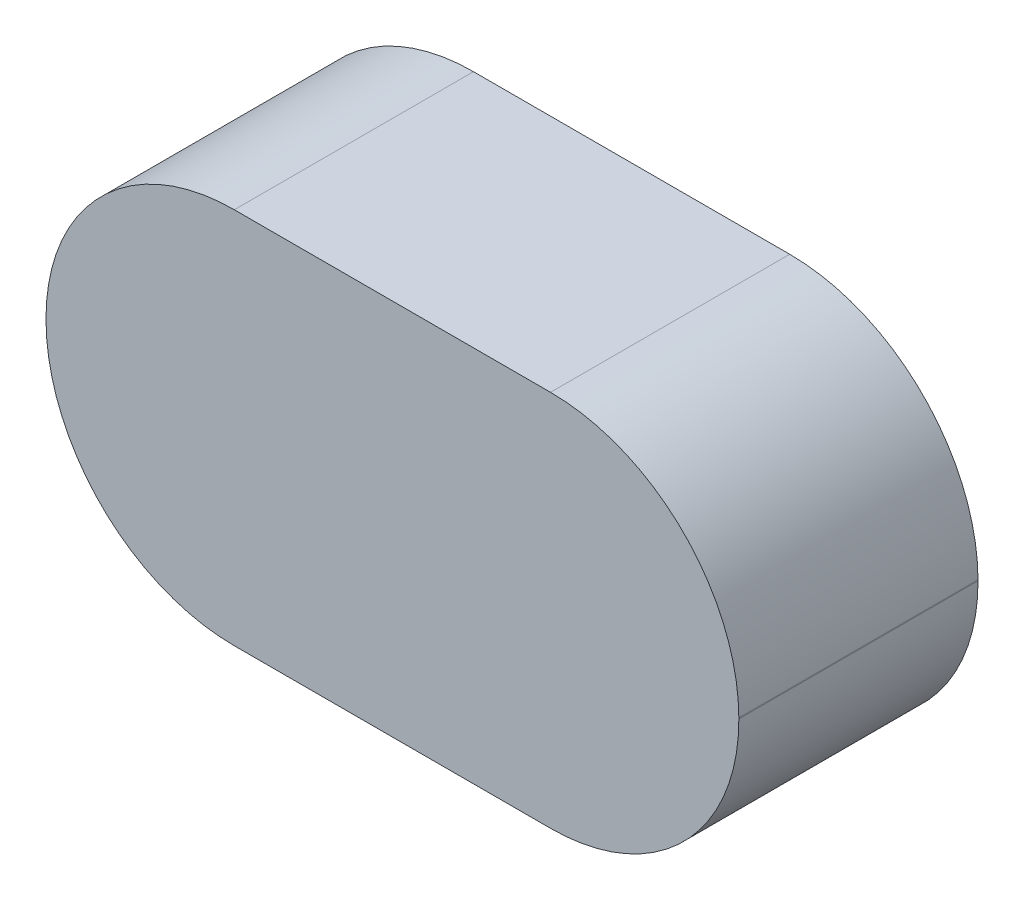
ISO-10303-21;
HEADER;
FILE_DESCRIPTION(('STEP AP214'),'2;1');
FILE_NAME('part.step','',(''),(''),'','','');
FILE_SCHEMA(('AUTOMOTIVE_DESIGN { 1 0 10303 214 1 1 1 1 }'));
ENDSEC;
DATA;
#1=APPLICATION_CONTEXT('core data for automotive mechanical design processes');
#2=APPLICATION_PROTOCOL_DEFINITION('international standard','automotive_design',2000,#1);
#3=PRODUCT_CONTEXT('',#1,'mechanical');
#4=PRODUCT('Part','Part','',(#3));
#5=PRODUCT_RELATED_PRODUCT_CATEGORY('part','',(#4));
#6=PRODUCT_DEFINITION_FORMATION('','',#4);
#7=PRODUCT_DEFINITION_CONTEXT('part definition',#1,'design');
#8=PRODUCT_DEFINITION('design','',#6,#7);
#9=PRODUCT_DEFINITION_SHAPE('','',#8);
#10=(LENGTH_UNIT() NAMED_UNIT(*) SI_UNIT(.MILLI.,.METRE.));
#11=(NAMED_UNIT(*) PLANE_ANGLE_UNIT() SI_UNIT($,.RADIAN.));
#12=(NAMED_UNIT(*) SI_UNIT($,.STERADIAN.) SOLID_ANGLE_UNIT());
#13=UNCERTAINTY_MEASURE_WITH_UNIT(LENGTH_MEASURE(1.E-05),#10,'distance_accuracy_value','');
#14=(GEOMETRIC_REPRESENTATION_CONTEXT(3) GLOBAL_UNCERTAINTY_ASSIGNED_CONTEXT((#13)) GLOBAL_UNIT_ASSIGNED_CONTEXT((#10,
#11,#12)) REPRESENTATION_CONTEXT('',''));
#15=CARTESIAN_POINT('',(0.,0.,0.));
#16=DIRECTION('',(0.,0.,1.));
#17=DIRECTION('',(1.,0.,0.));
#18=AXIS2_PLACEMENT_3D('',#15,#16,#17);
#19=CARTESIAN_POINT('',(-3.5,-2.1,2.413));
#20=DIRECTION('',(1.,0.,0.));
#21=DIRECTION('',(0.,0.,-1.));
#22=AXIS2_PLACEMENT_3D('',#19,#20,#21);
#23=PLANE('',#22);
#24=DIRECTION('',(0.,-1.,0.));
#25=VECTOR('',#24,1.);
#26=CARTESIAN_POINT('',(-3.5,-2.1,2.413));
#27=LINE('',#26,#25);
#28=CARTESIAN_POINT('',(-3.5,-0.190004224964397,2.413));
#29=VERTEX_POINT('',#28);
#30=CARTESIAN_POINT('',(-3.5,-0.199999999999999,2.413));
#31=VERTEX_POINT('',#30);
#32=EDGE_CURVE('E138',#29,#31,#27,.T.);
#33=ORIENTED_EDGE('',*,*,#32,.F.);
#34=DIRECTION('',(0.,0.,-1.));
#35=VECTOR('',#34,1.);
#36=CARTESIAN_POINT('',(-3.5,-0.190004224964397,2.413));
#37=LINE('',#36,#35);
#38=CARTESIAN_POINT('',(-3.5,-0.190004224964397,0.));
#39=VERTEX_POINT('',#38);
#40=EDGE_CURVE('E13',#29,#39,#37,.T.);
#41=ORIENTED_EDGE('',*,*,#40,.T.);
#42=DIRECTION('',(0.,-1.,0.));
#43=VECTOR('',#42,1.);
#44=CARTESIAN_POINT('',(-3.5,-2.1,0.));
#45=LINE('',#44,#43);
#46=CARTESIAN_POINT('',(-3.5,-0.199999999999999,0.));
#47=VERTEX_POINT('',#46);
#48=EDGE_CURVE('E140',#39,#47,#45,.T.);
#49=ORIENTED_EDGE('',*,*,#48,.T.);
#50=DIRECTION('',(0.,0.,-1.));
#51=VECTOR('',#50,1.);
#52=CARTESIAN_POINT('',(-3.5,-0.199999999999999,2.413));
#53=LINE('',#52,#51);
#54=EDGE_CURVE('E51',#47,#31,#53,.F.);
#55=ORIENTED_EDGE('',*,*,#54,.T.);
#56=EDGE_LOOP('',(#33,#41,#49,#55));
#57=FACE_BOUND('',#56,.T.);
#58=ADVANCED_FACE('F43',(#57),#23,.F.);
#59=CARTESIAN_POINT('',(3.49587914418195,-2.1,2.413));
#60=DIRECTION('',(0.,1.,0.));
#61=DIRECTION('',(-1.,0.,0.));
#62=AXIS2_PLACEMENT_3D('',#59,#60,#61);
#63=PLANE('',#62);
#64=DIRECTION('',(1.,0.,0.));
#65=VECTOR('',#64,1.);
#66=CARTESIAN_POINT('',(3.49587914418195,-2.1,0.));
#67=LINE('',#66,#65);
#68=CARTESIAN_POINT('',(-1.6,-2.1,0.));
#69=VERTEX_POINT('',#68);
#70=CARTESIAN_POINT('',(1.59044608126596,-2.1,0.));
#71=VERTEX_POINT('',#70);
#72=EDGE_CURVE('E136',#69,#71,#67,.T.);
#73=ORIENTED_EDGE('',*,*,#72,.T.);
#74=DIRECTION('',(0.,0.,-1.));
#75=VECTOR('',#74,1.);
#76=CARTESIAN_POINT('',(1.59044608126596,-2.1,2.413));
#77=LINE('',#76,#75);
#78=CARTESIAN_POINT('',(1.59044608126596,-2.1,2.413));
#79=VERTEX_POINT('',#78);
#80=EDGE_CURVE('E115',#71,#79,#77,.F.);
#81=ORIENTED_EDGE('',*,*,#80,.T.);
#82=DIRECTION('',(1.,0.,0.));
#83=VECTOR('',#82,1.);
#84=CARTESIAN_POINT('',(3.49587914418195,-2.1,2.413));
#85=LINE('',#84,#83);
#86=CARTESIAN_POINT('',(-1.6,-2.1,2.413));
#87=VERTEX_POINT('',#86);
#88=EDGE_CURVE('E176',#87,#79,#85,.T.);
#89=ORIENTED_EDGE('',*,*,#88,.F.);
#90=DIRECTION('',(0.,0.,-1.));
#91=VECTOR('',#90,1.);
#92=CARTESIAN_POINT('',(-1.6,-2.1,2.413));
#93=LINE('',#92,#91);
#94=EDGE_CURVE('E120',#87,#69,#93,.T.);
#95=ORIENTED_EDGE('',*,*,#94,.T.);
#96=EDGE_LOOP('',(#73,#81,#89,#95));
#97=FACE_BOUND('',#96,.T.);
#98=ADVANCED_FACE('F180',(#97),#63,.F.);
#99=CARTESIAN_POINT('',(3.48499999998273,1.70998446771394,2.413));
#100=DIRECTION('',(-0.999995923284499,-0.00285541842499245,0.));
#101=DIRECTION('',(0.00285541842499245,-0.999995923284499,0.));
#102=AXIS2_PLACEMENT_3D('',#99,#100,#101);
#103=PLANE('',#102);
#104=DIRECTION('',(-0.00285541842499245,0.999995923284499,0.));
#105=VECTOR('',#104,1.);
#106=CARTESIAN_POINT('',(3.48499999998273,1.70998446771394,2.413));
#107=LINE('',#106,#105);
#108=CARTESIAN_POINT('',(3.49043833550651,-0.194574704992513,2.413));
#109=VERTEX_POINT('',#108);
#110=CARTESIAN_POINT('',(3.49040981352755,-0.184586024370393,2.413));
#111=VERTEX_POINT('',#110);
#112=EDGE_CURVE('E129',#109,#111,#107,.T.);
#113=ORIENTED_EDGE('',*,*,#112,.F.);
#114=DIRECTION('',(0.,0.,-1.));
#115=VECTOR('',#114,1.);
#116=CARTESIAN_POINT('',(3.49043833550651,-0.194574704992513,2.413));
#117=LINE('',#116,#115);
#118=CARTESIAN_POINT('',(3.49043833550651,-0.194574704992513,0.));
#119=VERTEX_POINT('',#118);
#120=EDGE_CURVE('E114',#109,#119,#117,.T.);
#121=ORIENTED_EDGE('',*,*,#120,.T.);
#122=DIRECTION('',(-0.00285541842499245,0.999995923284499,0.));
#123=VECTOR('',#122,1.);
#124=CARTESIAN_POINT('',(3.48499999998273,1.70998446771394,0.));
#125=LINE('',#124,#123);
#126=CARTESIAN_POINT('',(3.49040981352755,-0.184586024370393,0.));
#127=VERTEX_POINT('',#126);
#128=EDGE_CURVE('E127',#119,#127,#125,.T.);
#129=ORIENTED_EDGE('',*,*,#128,.T.);
#130=DIRECTION('',(0.,0.,-1.));
#131=VECTOR('',#130,1.);
#132=CARTESIAN_POINT('',(3.49040981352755,-0.184586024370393,2.413));
#133=LINE('',#132,#131);
#134=EDGE_CURVE('E131',#127,#111,#133,.F.);
#135=ORIENTED_EDGE('',*,*,#134,.T.);
#136=EDGE_LOOP('',(#113,#121,#129,#135));
#137=FACE_BOUND('',#136,.T.);
#138=ADVANCED_FACE('F126',(#137),#103,.F.);
#139=CARTESIAN_POINT('',(-3.5,1.71,2.413));
#140=DIRECTION('',(-2.22366300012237E-06,-0.999999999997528,0.));
#141=DIRECTION('',(0.999999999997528,-2.22366300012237E-06,0.));
#142=AXIS2_PLACEMENT_3D('',#139,#140,#141);
#143=PLANE('',#142);
#144=DIRECTION('',(-0.999999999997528,2.22366300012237E-06,0.));
#145=VECTOR('',#144,1.);
#146=CARTESIAN_POINT('',(-3.5,1.71,2.413));
#147=LINE('',#146,#145);
#148=CARTESIAN_POINT('',(1.5904217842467,1.70998868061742,2.413));
#149=VERTEX_POINT('',#148);
#150=CARTESIAN_POINT('',(-1.5999957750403,1.70999577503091,2.413));
#151=VERTEX_POINT('',#150);
#152=EDGE_CURVE('E144',#149,#151,#147,.T.);
#153=ORIENTED_EDGE('',*,*,#152,.F.);
#154=DIRECTION('',(0.,0.,-1.));
#155=VECTOR('',#154,1.);
#156=CARTESIAN_POINT('',(1.5904217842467,1.70998868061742,2.413));
#157=LINE('',#156,#155);
#158=CARTESIAN_POINT('',(1.5904217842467,1.70998868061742,0.));
#159=VERTEX_POINT('',#158);
#160=EDGE_CURVE('E161',#149,#159,#157,.T.);
#161=ORIENTED_EDGE('',*,*,#160,.T.);
#162=DIRECTION('',(-0.999999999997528,2.22366300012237E-06,0.));
#163=VECTOR('',#162,1.);
#164=CARTESIAN_POINT('',(-3.5,1.71,0.));
#165=LINE('',#164,#163);
#166=CARTESIAN_POINT('',(-1.5999957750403,1.70999577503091,0.));
#167=VERTEX_POINT('',#166);
#168=EDGE_CURVE('E135',#159,#167,#165,.T.);
#169=ORIENTED_EDGE('',*,*,#168,.T.);
#170=DIRECTION('',(0.,0.,-1.));
#171=VECTOR('',#170,1.);
#172=CARTESIAN_POINT('',(-1.5999957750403,1.70999577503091,2.413));
#173=LINE('',#172,#171);
#174=EDGE_CURVE('E58',#167,#151,#173,.F.);
#175=ORIENTED_EDGE('',*,*,#174,.T.);
#176=EDGE_LOOP('',(#153,#161,#169,#175));
#177=FACE_BOUND('',#176,.T.);
#178=ADVANCED_FACE('F187',(#177),#143,.F.);
#179=CARTESIAN_POINT('',(0.,0.,2.413));
#180=DIRECTION('',(0.,0.,1.));
#181=DIRECTION('',(1.,0.,0.));
#182=AXIS2_PLACEMENT_3D('',#179,#180,#181);
#183=PLANE('',#182);
#184=ORIENTED_EDGE('',*,*,#88,.T.);
#185=CARTESIAN_POINT('',(1.59044608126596,-0.199999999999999,2.413));
#186=DIRECTION('',(0.,0.,1.));
#187=DIRECTION('',(1.,0.,0.));
#188=AXIS2_PLACEMENT_3D('',#185,#186,#187);
#189=CIRCLE('',#188,1.9);
#190=EDGE_CURVE('E158',#79,#109,#189,.T.);
#191=ORIENTED_EDGE('',*,*,#190,.T.);
#192=ORIENTED_EDGE('',*,*,#112,.T.);
#193=CARTESIAN_POINT('',(1.590417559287,-0.190011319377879,2.413));
#194=DIRECTION('',(0.,0.,1.));
#195=DIRECTION('',(1.,0.,0.));
#196=AXIS2_PLACEMENT_3D('',#193,#194,#195);
#197=CIRCLE('',#196,1.9);
#198=EDGE_CURVE('E65',#111,#149,#197,.T.);
#199=ORIENTED_EDGE('',*,*,#198,.T.);
#200=ORIENTED_EDGE('',*,*,#152,.T.);
#201=CARTESIAN_POINT('',(-1.6,-0.190004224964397,2.413));
#202=DIRECTION('',(0.,0.,1.));
#203=DIRECTION('',(1.,0.,0.));
#204=AXIS2_PLACEMENT_3D('',#201,#202,#203);
#205=CIRCLE('',#204,1.9);
#206=EDGE_CURVE('E155',#151,#29,#205,.T.);
#207=ORIENTED_EDGE('',*,*,#206,.T.);
#208=ORIENTED_EDGE('',*,*,#32,.T.);
#209=CARTESIAN_POINT('',(-1.6,-0.199999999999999,2.413));
#210=DIRECTION('',(0.,0.,1.));
#211=DIRECTION('',(1.,0.,0.));
#212=AXIS2_PLACEMENT_3D('',#209,#210,#211);
#213=CIRCLE('',#212,1.9);
#214=EDGE_CURVE('E153',#31,#87,#213,.T.);
#215=ORIENTED_EDGE('',*,*,#214,.T.);
#216=EDGE_LOOP('',(#184,#191,#192,#199,#200,#207,#208,#215));
#217=FACE_BOUND('',#216,.T.);
#218=ADVANCED_FACE('F173',(#217),#183,.T.);
#219=CARTESIAN_POINT('',(0.,0.,0.));
#220=DIRECTION('',(0.,0.,1.));
#221=DIRECTION('',(1.,0.,0.));
#222=AXIS2_PLACEMENT_3D('',#219,#220,#221);
#223=PLANE('',#222);
#224=ORIENTED_EDGE('',*,*,#128,.F.);
#225=CARTESIAN_POINT('',(1.59044608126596,-0.199999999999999,0.));
#226=DIRECTION('',(0.,0.,1.));
#227=DIRECTION('',(1.,0.,0.));
#228=AXIS2_PLACEMENT_3D('',#225,#226,#227);
#229=CIRCLE('',#228,1.9);
#230=EDGE_CURVE('E110',#119,#71,#229,.F.);
#231=ORIENTED_EDGE('',*,*,#230,.T.);
#232=ORIENTED_EDGE('',*,*,#72,.F.);
#233=CARTESIAN_POINT('',(-1.6,-0.199999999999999,0.));
#234=DIRECTION('',(0.,0.,1.));
#235=DIRECTION('',(1.,0.,0.));
#236=AXIS2_PLACEMENT_3D('',#233,#234,#235);
#237=CIRCLE('',#236,1.9);
#238=EDGE_CURVE('E130',#69,#47,#237,.F.);
#239=ORIENTED_EDGE('',*,*,#238,.T.);
#240=ORIENTED_EDGE('',*,*,#48,.F.);
#241=CARTESIAN_POINT('',(-1.6,-0.190004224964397,0.));
#242=DIRECTION('',(0.,0.,1.));
#243=DIRECTION('',(1.,0.,0.));
#244=AXIS2_PLACEMENT_3D('',#241,#242,#243);
#245=CIRCLE('',#244,1.9);
#246=EDGE_CURVE('E147',#39,#167,#245,.F.);
#247=ORIENTED_EDGE('',*,*,#246,.T.);
#248=ORIENTED_EDGE('',*,*,#168,.F.);
#249=CARTESIAN_POINT('',(1.590417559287,-0.190011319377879,0.));
#250=DIRECTION('',(0.,0.,1.));
#251=DIRECTION('',(1.,0.,0.));
#252=AXIS2_PLACEMENT_3D('',#249,#250,#251);
#253=CIRCLE('',#252,1.9);
#254=EDGE_CURVE('E121',#159,#127,#253,.F.);
#255=ORIENTED_EDGE('',*,*,#254,.T.);
#256=EDGE_LOOP('',(#224,#231,#232,#239,#240,#247,#248,#255));
#257=FACE_BOUND('',#256,.T.);
#258=ADVANCED_FACE('F133',(#257),#223,.F.);
#259=CARTESIAN_POINT('',(1.59044608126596,-0.199999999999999,2.413));
#260=DIRECTION('',(0.,0.,-1.));
#261=DIRECTION('',(-1.,0.,0.));
#262=AXIS2_PLACEMENT_3D('',#259,#260,#261);
#263=CYLINDRICAL_SURFACE('',#262,1.9);
#264=ORIENTED_EDGE('',*,*,#190,.F.);
#265=ORIENTED_EDGE('',*,*,#80,.F.);
#266=ORIENTED_EDGE('',*,*,#230,.F.);
#267=ORIENTED_EDGE('',*,*,#120,.F.);
#268=EDGE_LOOP('',(#264,#265,#266,#267));
#269=FACE_BOUND('',#268,.T.);
#270=ADVANCED_FACE('F113',(#269),#263,.T.);
#271=CARTESIAN_POINT('',(1.590417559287,-0.190011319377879,2.413));
#272=DIRECTION('',(0.,0.,-1.));
#273=DIRECTION('',(-1.,0.,0.));
#274=AXIS2_PLACEMENT_3D('',#271,#272,#273);
#275=CYLINDRICAL_SURFACE('',#274,1.9);
#276=ORIENTED_EDGE('',*,*,#198,.F.);
#277=ORIENTED_EDGE('',*,*,#134,.F.);
#278=ORIENTED_EDGE('',*,*,#254,.F.);
#279=ORIENTED_EDGE('',*,*,#160,.F.);
#280=EDGE_LOOP('',(#276,#277,#278,#279));
#281=FACE_BOUND('',#280,.T.);
#282=ADVANCED_FACE('F186',(#281),#275,.T.);
#283=CARTESIAN_POINT('',(-1.6,-0.190004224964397,2.413));
#284=DIRECTION('',(0.,0.,-1.));
#285=DIRECTION('',(-1.,0.,0.));
#286=AXIS2_PLACEMENT_3D('',#283,#284,#285);
#287=CYLINDRICAL_SURFACE('',#286,1.9);
#288=ORIENTED_EDGE('',*,*,#206,.F.);
#289=ORIENTED_EDGE('',*,*,#174,.F.);
#290=ORIENTED_EDGE('',*,*,#246,.F.);
#291=ORIENTED_EDGE('',*,*,#40,.F.);
#292=EDGE_LOOP('',(#288,#289,#290,#291));
#293=FACE_BOUND('',#292,.T.);
#294=ADVANCED_FACE('F189',(#293),#287,.T.);
#295=CARTESIAN_POINT('',(-1.6,-0.199999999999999,2.413));
#296=DIRECTION('',(0.,0.,-1.));
#297=DIRECTION('',(-1.,0.,0.));
#298=AXIS2_PLACEMENT_3D('',#295,#296,#297);
#299=CYLINDRICAL_SURFACE('',#298,1.9);
#300=ORIENTED_EDGE('',*,*,#214,.F.);
#301=ORIENTED_EDGE('',*,*,#54,.F.);
#302=ORIENTED_EDGE('',*,*,#238,.F.);
#303=ORIENTED_EDGE('',*,*,#94,.F.);
#304=EDGE_LOOP('',(#300,#301,#302,#303));
#305=FACE_BOUND('',#304,.T.);
#306=ADVANCED_FACE('F45',(#305),#299,.T.);
#307=CLOSED_SHELL('',(#58,#98,#138,#178,#218,#258,#270,#282,#294,#306));
#308=MANIFOLD_SOLID_BREP('B2',#307);
#309=ADVANCED_BREP_SHAPE_REPRESENTATION('',(#18,#308),#14);
#310=SHAPE_DEFINITION_REPRESENTATION(#9,#309);
ENDSEC;
END-ISO-10303-21;
